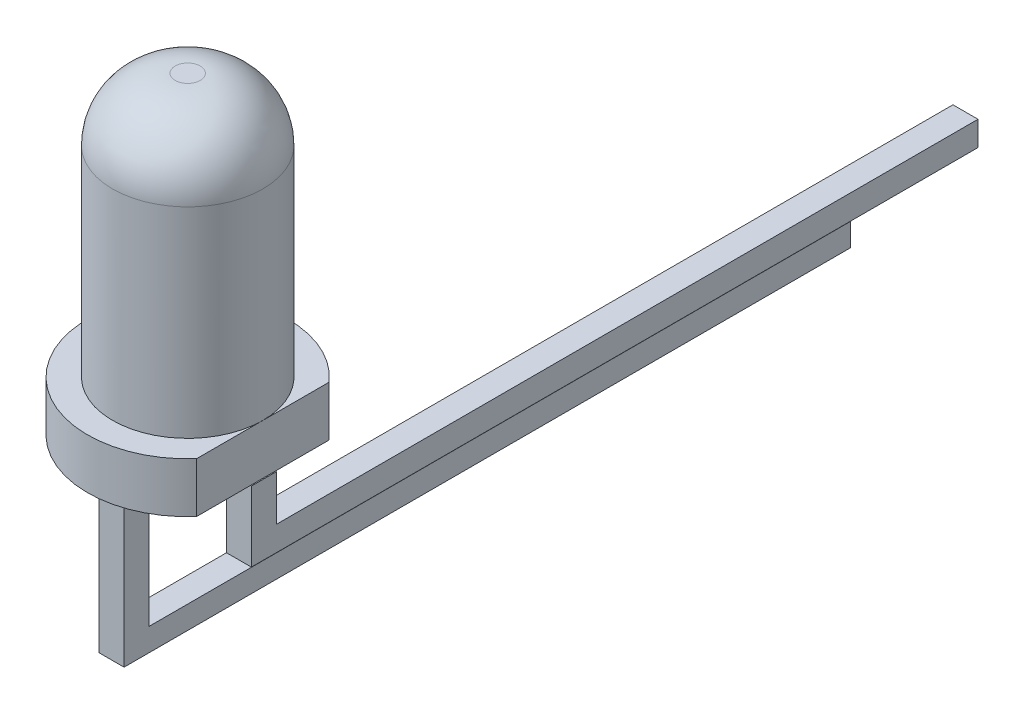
ISO-10303-21;
HEADER;
FILE_DESCRIPTION(('STEP AP214'),'2;1');
FILE_NAME('part.step','',(''),(''),'','','');
FILE_SCHEMA(('AUTOMOTIVE_DESIGN { 1 0 10303 214 1 1 1 1 }'));
ENDSEC;
DATA;
#1=APPLICATION_CONTEXT('core data for automotive mechanical design processes');
#2=APPLICATION_PROTOCOL_DEFINITION('international standard','automotive_design',2000,#1);
#3=PRODUCT_CONTEXT('',#1,'mechanical');
#4=PRODUCT('Part','Part','',(#3));
#5=PRODUCT_RELATED_PRODUCT_CATEGORY('part','',(#4));
#6=PRODUCT_DEFINITION_FORMATION('','',#4);
#7=PRODUCT_DEFINITION_CONTEXT('part definition',#1,'design');
#8=PRODUCT_DEFINITION('design','',#6,#7);
#9=PRODUCT_DEFINITION_SHAPE('','',#8);
#10=(LENGTH_UNIT() NAMED_UNIT(*) SI_UNIT(.MILLI.,.METRE.));
#11=(NAMED_UNIT(*) PLANE_ANGLE_UNIT() SI_UNIT($,.RADIAN.));
#12=(NAMED_UNIT(*) SI_UNIT($,.STERADIAN.) SOLID_ANGLE_UNIT());
#13=UNCERTAINTY_MEASURE_WITH_UNIT(LENGTH_MEASURE(1.E-05),#10,'distance_accuracy_value','');
#14=(GEOMETRIC_REPRESENTATION_CONTEXT(3) GLOBAL_UNCERTAINTY_ASSIGNED_CONTEXT((#13)) GLOBAL_UNIT_ASSIGNED_CONTEXT((#10,
#11,#12)) REPRESENTATION_CONTEXT('',''));
#15=CARTESIAN_POINT('',(0.,0.,0.));
#16=DIRECTION('',(0.,0.,1.));
#17=DIRECTION('',(1.,0.,0.));
#18=AXIS2_PLACEMENT_3D('',#15,#16,#17);
#19=CARTESIAN_POINT('',(-1.52014292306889,-1.4,-0.25));
#20=DIRECTION('',(0.,0.,1.));
#21=DIRECTION('',(1.,0.,0.));
#22=AXIS2_PLACEMENT_3D('',#19,#20,#21);
#23=PLANE('',#22);
#24=DIRECTION('',(1.,0.,0.));
#25=VECTOR('',#24,1.);
#26=CARTESIAN_POINT('',(-1.02014292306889,-3.94389942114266,-0.25));
#27=LINE('',#26,#25);
#28=CARTESIAN_POINT('',(-1.52014292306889,-3.94389942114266,-0.25));
#29=VERTEX_POINT('',#28);
#30=CARTESIAN_POINT('',(-1.02014292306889,-3.94389942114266,-0.25));
#31=VERTEX_POINT('',#30);
#32=EDGE_CURVE('E193',#29,#31,#27,.T.);
#33=ORIENTED_EDGE('',*,*,#32,.F.);
#34=DIRECTION('',(0.,1.,0.));
#35=VECTOR('',#34,1.);
#36=CARTESIAN_POINT('',(-1.52014292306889,-1.4,-0.25));
#37=LINE('',#36,#35);
#38=CARTESIAN_POINT('',(-1.52014292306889,0.,-0.25));
#39=VERTEX_POINT('',#38);
#40=EDGE_CURVE('E291',#29,#39,#37,.T.);
#41=ORIENTED_EDGE('',*,*,#40,.T.);
#42=DIRECTION('',(1.,0.,0.));
#43=VECTOR('',#42,1.);
#44=CARTESIAN_POINT('',(-1.52014292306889,0.,-0.25));
#45=LINE('',#44,#43);
#46=CARTESIAN_POINT('',(-1.02014292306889,0.,-0.25));
#47=VERTEX_POINT('',#46);
#48=EDGE_CURVE('E271',#39,#47,#45,.T.);
#49=ORIENTED_EDGE('',*,*,#48,.T.);
#50=DIRECTION('',(0.,1.,0.));
#51=VECTOR('',#50,1.);
#52=CARTESIAN_POINT('',(-1.02014292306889,-1.4,-0.25));
#53=LINE('',#52,#51);
#54=EDGE_CURVE('E288',#31,#47,#53,.T.);
#55=ORIENTED_EDGE('',*,*,#54,.F.);
#56=EDGE_LOOP('',(#33,#41,#49,#55));
#57=FACE_BOUND('',#56,.T.);
#58=ADVANCED_FACE('F38',(#57),#23,.F.);
#59=CARTESIAN_POINT('',(1.02017272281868,-1.4,-0.25));
#60=DIRECTION('',(0.,0.,1.));
#61=DIRECTION('',(1.,0.,0.));
#62=AXIS2_PLACEMENT_3D('',#59,#60,#61);
#63=PLANE('',#62);
#64=DIRECTION('',(1.,0.,0.));
#65=VECTOR('',#64,1.);
#66=CARTESIAN_POINT('',(1.02017272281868,-0.91036424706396,-0.25));
#67=LINE('',#66,#65);
#68=CARTESIAN_POINT('',(1.02017272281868,-0.91036424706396,-0.25));
#69=VERTEX_POINT('',#68);
#70=CARTESIAN_POINT('',(1.52017272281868,-0.91036424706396,-0.25));
#71=VERTEX_POINT('',#70);
#72=EDGE_CURVE('E176',#69,#71,#67,.T.);
#73=ORIENTED_EDGE('',*,*,#72,.F.);
#74=DIRECTION('',(0.,1.,0.));
#75=VECTOR('',#74,1.);
#76=CARTESIAN_POINT('',(1.02017272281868,-1.4,-0.25));
#77=LINE('',#76,#75);
#78=CARTESIAN_POINT('',(1.02017272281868,0.,-0.25));
#79=VERTEX_POINT('',#78);
#80=EDGE_CURVE('E61',#69,#79,#77,.T.);
#81=ORIENTED_EDGE('',*,*,#80,.T.);
#82=DIRECTION('',(1.,0.,0.));
#83=VECTOR('',#82,1.);
#84=CARTESIAN_POINT('',(1.02017272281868,0.,-0.25));
#85=LINE('',#84,#83);
#86=CARTESIAN_POINT('',(1.5,0.,-0.25));
#87=VERTEX_POINT('',#86);
#88=EDGE_CURVE('E251',#79,#87,#85,.T.);
#89=ORIENTED_EDGE('',*,*,#88,.T.);
#90=DIRECTION('',(-1.,0.,0.));
#91=VECTOR('',#90,1.);
#92=CARTESIAN_POINT('',(1.02017272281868,0.,-0.25));
#93=LINE('',#92,#91);
#94=CARTESIAN_POINT('',(1.52017272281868,0.,-0.25));
#95=VERTEX_POINT('',#94);
#96=EDGE_CURVE('E237',#95,#87,#93,.T.);
#97=ORIENTED_EDGE('',*,*,#96,.F.);
#98=DIRECTION('',(0.,1.,0.));
#99=VECTOR('',#98,1.);
#100=CARTESIAN_POINT('',(1.52017272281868,-1.4,-0.25));
#101=LINE('',#100,#99);
#102=EDGE_CURVE('E264',#71,#95,#101,.T.);
#103=ORIENTED_EDGE('',*,*,#102,.F.);
#104=EDGE_LOOP('',(#73,#81,#89,#97,#103));
#105=FACE_BOUND('',#104,.T.);
#106=ADVANCED_FACE('F332',(#105),#63,.F.);
#107=CARTESIAN_POINT('',(0.,0.,0.));
#108=DIRECTION('',(0.,1.,0.));
#109=DIRECTION('',(0.,0.,1.));
#110=AXIS2_PLACEMENT_3D('',#107,#108,#109);
#111=PLANE('',#110);
#112=DIRECTION('',(0.,0.,-1.));
#113=VECTOR('',#112,1.);
#114=CARTESIAN_POINT('',(-1.52014292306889,0.,-0.25));
#115=LINE('',#114,#113);
#116=CARTESIAN_POINT('',(-1.52014292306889,0.,0.25));
#117=VERTEX_POINT('',#116);
#118=EDGE_CURVE('E267',#117,#39,#115,.T.);
#119=ORIENTED_EDGE('',*,*,#118,.F.);
#120=DIRECTION('',(-1.,0.,0.));
#121=VECTOR('',#120,1.);
#122=CARTESIAN_POINT('',(-1.52014292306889,0.,0.25));
#123=LINE('',#122,#121);
#124=CARTESIAN_POINT('',(-1.02014292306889,0.,0.25));
#125=VERTEX_POINT('',#124);
#126=EDGE_CURVE('E278',#125,#117,#123,.T.);
#127=ORIENTED_EDGE('',*,*,#126,.F.);
#128=DIRECTION('',(0.,0.,1.));
#129=VECTOR('',#128,1.);
#130=CARTESIAN_POINT('',(-1.02014292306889,0.,-0.25));
#131=LINE('',#130,#129);
#132=EDGE_CURVE('E275',#47,#125,#131,.T.);
#133=ORIENTED_EDGE('',*,*,#132,.F.);
#134=ORIENTED_EDGE('',*,*,#48,.F.);
#135=EDGE_LOOP('',(#119,#127,#133,#134));
#136=FACE_BOUND('',#135,.T.);
#137=CARTESIAN_POINT('',(0.,0.,0.));
#138=DIRECTION('',(0.,1.,0.));
#139=DIRECTION('',(0.,0.,1.));
#140=AXIS2_PLACEMENT_3D('',#137,#138,#139);
#141=CIRCLE('',#140,2.);
#142=CARTESIAN_POINT('',(1.5,0.,-1.3228756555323));
#143=VERTEX_POINT('',#142);
#144=CARTESIAN_POINT('',(1.5,0.,1.32287565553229));
#145=VERTEX_POINT('',#144);
#146=EDGE_CURVE('E298',#143,#145,#141,.T.);
#147=ORIENTED_EDGE('',*,*,#146,.F.);
#148=DIRECTION('',(0.,0.,-1.));
#149=VECTOR('',#148,1.);
#150=CARTESIAN_POINT('',(1.5,0.,-2.73044739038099));
#151=LINE('',#150,#149);
#152=EDGE_CURVE('E234',#87,#143,#151,.T.);
#153=ORIENTED_EDGE('',*,*,#152,.F.);
#154=ORIENTED_EDGE('',*,*,#88,.F.);
#155=DIRECTION('',(0.,0.,-1.));
#156=VECTOR('',#155,1.);
#157=CARTESIAN_POINT('',(1.02017272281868,0.,-0.25));
#158=LINE('',#157,#156);
#159=CARTESIAN_POINT('',(1.02017272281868,0.,0.25));
#160=VERTEX_POINT('',#159);
#161=EDGE_CURVE('E239',#160,#79,#158,.T.);
#162=ORIENTED_EDGE('',*,*,#161,.F.);
#163=DIRECTION('',(-1.,0.,0.));
#164=VECTOR('',#163,1.);
#165=CARTESIAN_POINT('',(1.02017272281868,0.,0.25));
#166=LINE('',#165,#164);
#167=CARTESIAN_POINT('',(1.5,0.,0.25));
#168=VERTEX_POINT('',#167);
#169=EDGE_CURVE('E256',#168,#160,#166,.T.);
#170=ORIENTED_EDGE('',*,*,#169,.F.);
#171=EDGE_CURVE('E53',#145,#168,#151,.T.);
#172=ORIENTED_EDGE('',*,*,#171,.F.);
#173=EDGE_LOOP('',(#147,#153,#154,#162,#170,#172));
#174=FACE_BOUND('',#173,.T.);
#175=ADVANCED_FACE('F338',(#136,#174),#111,.F.);
#176=CARTESIAN_POINT('',(0.,1.,0.));
#177=DIRECTION('',(0.,1.,0.));
#178=DIRECTION('',(0.,0.,1.));
#179=AXIS2_PLACEMENT_3D('',#176,#177,#178);
#180=PLANE('',#179);
#181=DIRECTION('',(0.,0.,1.));
#182=VECTOR('',#181,1.);
#183=CARTESIAN_POINT('',(1.5,1.,-2.73044739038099));
#184=LINE('',#183,#182);
#185=CARTESIAN_POINT('',(1.5,1.,-1.3228756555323));
#186=VERTEX_POINT('',#185);
#187=CARTESIAN_POINT('',(1.5,1.,0.));
#188=VERTEX_POINT('',#187);
#189=EDGE_CURVE('E233',#186,#188,#184,.T.);
#190=ORIENTED_EDGE('',*,*,#189,.F.);
#191=CARTESIAN_POINT('',(0.,1.,0.));
#192=DIRECTION('',(0.,1.,0.));
#193=DIRECTION('',(0.,0.,1.));
#194=AXIS2_PLACEMENT_3D('',#191,#192,#193);
#195=CIRCLE('',#194,2.);
#196=CARTESIAN_POINT('',(1.5,1.,1.32287565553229));
#197=VERTEX_POINT('',#196);
#198=EDGE_CURVE('E299',#186,#197,#195,.T.);
#199=ORIENTED_EDGE('',*,*,#198,.T.);
#200=EDGE_CURVE('E231',#188,#197,#184,.T.);
#201=ORIENTED_EDGE('',*,*,#200,.F.);
#202=CARTESIAN_POINT('',(0.,1.,0.));
#203=DIRECTION('',(0.,1.,0.));
#204=DIRECTION('',(0.,0.,1.));
#205=AXIS2_PLACEMENT_3D('',#202,#203,#204);
#206=CIRCLE('',#205,1.5);
#207=EDGE_CURVE('E294',#188,#188,#206,.T.);
#208=ORIENTED_EDGE('',*,*,#207,.F.);
#209=EDGE_LOOP('',(#190,#199,#201,#208));
#210=FACE_BOUND('',#209,.T.);
#211=ADVANCED_FACE('F355',(#210),#180,.T.);
#212=CARTESIAN_POINT('',(0.,1.,0.));
#213=DIRECTION('',(0.,-1.,0.));
#214=DIRECTION('',(0.,0.,-1.));
#215=AXIS2_PLACEMENT_3D('',#212,#213,#214);
#216=CYLINDRICAL_SURFACE('',#215,2.);
#217=ORIENTED_EDGE('',*,*,#198,.F.);
#218=DIRECTION('',(0.,-1.,0.));
#219=VECTOR('',#218,1.);
#220=CARTESIAN_POINT('',(1.5,1.,-1.3228756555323));
#221=LINE('',#220,#219);
#222=EDGE_CURVE('E309',#186,#143,#221,.T.);
#223=ORIENTED_EDGE('',*,*,#222,.T.);
#224=ORIENTED_EDGE('',*,*,#146,.T.);
#225=DIRECTION('',(0.,-1.,0.));
#226=VECTOR('',#225,1.);
#227=CARTESIAN_POINT('',(1.5,1.,1.32287565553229));
#228=LINE('',#227,#226);
#229=EDGE_CURVE('E303',#145,#197,#228,.F.);
#230=ORIENTED_EDGE('',*,*,#229,.T.);
#231=EDGE_LOOP('',(#217,#223,#224,#230));
#232=FACE_BOUND('',#231,.T.);
#233=ADVANCED_FACE('F353',(#232),#216,.T.);
#234=CARTESIAN_POINT('',(0.,6.25,0.));
#235=DIRECTION('',(0.,-1.,0.));
#236=DIRECTION('',(0.,0.,-1.));
#237=AXIS2_PLACEMENT_3D('',#234,#235,#236);
#238=CYLINDRICAL_SURFACE('',#237,1.5);
#239=CARTESIAN_POINT('',(0.,5.,0.));
#240=DIRECTION('',(0.,1.,0.));
#241=DIRECTION('',(0.,0.,1.));
#242=AXIS2_PLACEMENT_3D('',#239,#240,#241);
#243=CIRCLE('',#242,1.5);
#244=CARTESIAN_POINT('',(0.,5.,1.5));
#245=VERTEX_POINT('',#244);
#246=EDGE_CURVE('E12',#245,#245,#243,.F.);
#247=ORIENTED_EDGE('',*,*,#246,.T.);
#248=EDGE_LOOP('',(#247));
#249=FACE_BOUND('',#248,.T.);
#250=ORIENTED_EDGE('',*,*,#207,.T.);
#251=EDGE_LOOP('',(#250));
#252=FACE_BOUND('',#251,.T.);
#253=ADVANCED_FACE('F350',(#249,#252),#238,.T.);
#254=CARTESIAN_POINT('',(0.,6.25,0.));
#255=DIRECTION('',(0.,1.,0.));
#256=DIRECTION('',(0.,0.,1.));
#257=AXIS2_PLACEMENT_3D('',#254,#255,#256);
#258=PLANE('',#257);
#259=CARTESIAN_POINT('',(0.,6.25,0.));
#260=DIRECTION('',(0.,1.,0.));
#261=DIRECTION('',(0.,0.,1.));
#262=AXIS2_PLACEMENT_3D('',#259,#260,#261);
#263=CIRCLE('',#262,0.25);
#264=CARTESIAN_POINT('',(0.,6.25,0.25));
#265=VERTEX_POINT('',#264);
#266=EDGE_CURVE('E46',#265,#265,#263,.T.);
#267=ORIENTED_EDGE('',*,*,#266,.T.);
#268=EDGE_LOOP('',(#267));
#269=FACE_BOUND('',#268,.T.);
#270=ADVANCED_FACE('F314',(#269),#258,.T.);
#271=CARTESIAN_POINT('',(-1.52014292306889,-1.4,-0.25));
#272=DIRECTION('',(1.,0.,0.));
#273=DIRECTION('',(0.,0.,-1.));
#274=AXIS2_PLACEMENT_3D('',#271,#272,#273);
#275=PLANE('',#274);
#276=ORIENTED_EDGE('',*,*,#118,.T.);
#277=ORIENTED_EDGE('',*,*,#40,.F.);
#278=DIRECTION('',(0.,0.,1.));
#279=VECTOR('',#278,1.);
#280=CARTESIAN_POINT('',(-1.52014292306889,-3.94389942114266,-14.25));
#281=LINE('',#280,#279);
#282=CARTESIAN_POINT('',(-1.52014292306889,-3.94389942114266,-14.25));
#283=VERTEX_POINT('',#282);
#284=EDGE_CURVE('E205',#283,#29,#281,.T.);
#285=ORIENTED_EDGE('',*,*,#284,.F.);
#286=DIRECTION('',(0.,1.,0.));
#287=VECTOR('',#286,1.);
#288=CARTESIAN_POINT('',(-1.52014292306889,-4.4,-14.25));
#289=LINE('',#288,#287);
#290=CARTESIAN_POINT('',(-1.52014292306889,-4.4,-14.25));
#291=VERTEX_POINT('',#290);
#292=EDGE_CURVE('E186',#291,#283,#289,.T.);
#293=ORIENTED_EDGE('',*,*,#292,.F.);
#294=DIRECTION('',(0.,0.,-1.));
#295=VECTOR('',#294,1.);
#296=CARTESIAN_POINT('',(-1.52014292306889,-4.4,0.25));
#297=LINE('',#296,#295);
#298=CARTESIAN_POINT('',(-1.52014292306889,-4.4,0.25));
#299=VERTEX_POINT('',#298);
#300=EDGE_CURVE('E177',#299,#291,#297,.T.);
#301=ORIENTED_EDGE('',*,*,#300,.F.);
#302=DIRECTION('',(0.,1.,0.));
#303=VECTOR('',#302,1.);
#304=CARTESIAN_POINT('',(-1.52014292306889,-1.4,0.25));
#305=LINE('',#304,#303);
#306=EDGE_CURVE('E282',#299,#117,#305,.T.);
#307=ORIENTED_EDGE('',*,*,#306,.T.);
#308=EDGE_LOOP('',(#276,#277,#285,#293,#301,#307));
#309=FACE_BOUND('',#308,.T.);
#310=ADVANCED_FACE('F344',(#309),#275,.F.);
#311=CARTESIAN_POINT('',(-1.02014292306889,-1.4,-0.25));
#312=DIRECTION('',(-1.,0.,0.));
#313=DIRECTION('',(0.,0.,1.));
#314=AXIS2_PLACEMENT_3D('',#311,#312,#313);
#315=PLANE('',#314);
#316=ORIENTED_EDGE('',*,*,#132,.T.);
#317=DIRECTION('',(0.,1.,0.));
#318=VECTOR('',#317,1.);
#319=CARTESIAN_POINT('',(-1.02014292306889,-1.4,0.25));
#320=LINE('',#319,#318);
#321=CARTESIAN_POINT('',(-1.02014292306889,-4.4,0.25));
#322=VERTEX_POINT('',#321);
#323=EDGE_CURVE('E171',#322,#125,#320,.T.);
#324=ORIENTED_EDGE('',*,*,#323,.F.);
#325=DIRECTION('',(0.,0.,1.));
#326=VECTOR('',#325,1.);
#327=CARTESIAN_POINT('',(-1.02014292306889,-4.4,-0.25));
#328=LINE('',#327,#326);
#329=CARTESIAN_POINT('',(-1.02014292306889,-4.4,-14.25));
#330=VERTEX_POINT('',#329);
#331=EDGE_CURVE('E163',#330,#322,#328,.T.);
#332=ORIENTED_EDGE('',*,*,#331,.F.);
#333=DIRECTION('',(0.,-1.,0.));
#334=VECTOR('',#333,1.);
#335=CARTESIAN_POINT('',(-1.02014292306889,-3.94389942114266,-14.25));
#336=LINE('',#335,#334);
#337=CARTESIAN_POINT('',(-1.02014292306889,-3.94389942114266,-14.25));
#338=VERTEX_POINT('',#337);
#339=EDGE_CURVE('E169',#338,#330,#336,.T.);
#340=ORIENTED_EDGE('',*,*,#339,.F.);
#341=DIRECTION('',(0.,0.,1.));
#342=VECTOR('',#341,1.);
#343=CARTESIAN_POINT('',(-1.02014292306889,-3.94389942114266,-14.25));
#344=LINE('',#343,#342);
#345=EDGE_CURVE('E201',#338,#31,#344,.T.);
#346=ORIENTED_EDGE('',*,*,#345,.T.);
#347=ORIENTED_EDGE('',*,*,#54,.T.);
#348=EDGE_LOOP('',(#316,#324,#332,#340,#346,#347));
#349=FACE_BOUND('',#348,.T.);
#350=ADVANCED_FACE('F166',(#349),#315,.F.);
#351=CARTESIAN_POINT('',(-1.52014292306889,-1.4,0.25));
#352=DIRECTION('',(0.,0.,-1.));
#353=DIRECTION('',(-1.,0.,0.));
#354=AXIS2_PLACEMENT_3D('',#351,#352,#353);
#355=PLANE('',#354);
#356=ORIENTED_EDGE('',*,*,#126,.T.);
#357=ORIENTED_EDGE('',*,*,#306,.F.);
#358=DIRECTION('',(-1.,0.,0.));
#359=VECTOR('',#358,1.);
#360=CARTESIAN_POINT('',(-1.02014292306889,-4.4,0.25));
#361=LINE('',#360,#359);
#362=EDGE_CURVE('E208',#322,#299,#361,.T.);
#363=ORIENTED_EDGE('',*,*,#362,.F.);
#364=ORIENTED_EDGE('',*,*,#323,.T.);
#365=EDGE_LOOP('',(#356,#357,#363,#364));
#366=FACE_BOUND('',#365,.T.);
#367=ADVANCED_FACE('F396',(#366),#355,.F.);
#368=CARTESIAN_POINT('',(1.02017272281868,-1.4,-0.25));
#369=DIRECTION('',(1.,0.,0.));
#370=DIRECTION('',(0.,0.,-1.));
#371=AXIS2_PLACEMENT_3D('',#368,#369,#370);
#372=PLANE('',#371);
#373=ORIENTED_EDGE('',*,*,#161,.T.);
#374=ORIENTED_EDGE('',*,*,#80,.F.);
#375=DIRECTION('',(0.,0.,1.));
#376=VECTOR('',#375,1.);
#377=CARTESIAN_POINT('',(1.02017272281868,-0.91036424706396,-14.25));
#378=LINE('',#377,#376);
#379=CARTESIAN_POINT('',(1.02017272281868,-0.91036424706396,-14.25));
#380=VERTEX_POINT('',#379);
#381=EDGE_CURVE('E224',#380,#69,#378,.T.);
#382=ORIENTED_EDGE('',*,*,#381,.F.);
#383=DIRECTION('',(0.,1.,0.));
#384=VECTOR('',#383,1.);
#385=CARTESIAN_POINT('',(1.02017272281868,-1.4,-14.25));
#386=LINE('',#385,#384);
#387=CARTESIAN_POINT('',(1.02017272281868,-1.4,-14.25));
#388=VERTEX_POINT('',#387);
#389=EDGE_CURVE('E222',#388,#380,#386,.T.);
#390=ORIENTED_EDGE('',*,*,#389,.F.);
#391=DIRECTION('',(0.,0.,-1.));
#392=VECTOR('',#391,1.);
#393=CARTESIAN_POINT('',(1.02017272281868,-1.4,-0.25));
#394=LINE('',#393,#392);
#395=CARTESIAN_POINT('',(1.02017272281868,-1.4,0.25));
#396=VERTEX_POINT('',#395);
#397=EDGE_CURVE('E240',#396,#388,#394,.T.);
#398=ORIENTED_EDGE('',*,*,#397,.F.);
#399=DIRECTION('',(0.,1.,0.));
#400=VECTOR('',#399,1.);
#401=CARTESIAN_POINT('',(1.02017272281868,-1.4,0.25));
#402=LINE('',#401,#400);
#403=EDGE_CURVE('E248',#396,#160,#402,.T.);
#404=ORIENTED_EDGE('',*,*,#403,.T.);
#405=EDGE_LOOP('',(#373,#374,#382,#390,#398,#404));
#406=FACE_BOUND('',#405,.T.);
#407=ADVANCED_FACE('F394',(#406),#372,.F.);
#408=CARTESIAN_POINT('',(1.52017272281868,-1.4,-0.25));
#409=DIRECTION('',(-1.,0.,0.));
#410=DIRECTION('',(0.,0.,1.));
#411=AXIS2_PLACEMENT_3D('',#408,#409,#410);
#412=PLANE('',#411);
#413=DIRECTION('',(0.,0.,1.));
#414=VECTOR('',#413,1.);
#415=CARTESIAN_POINT('',(1.52017272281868,0.,-0.25));
#416=LINE('',#415,#414);
#417=CARTESIAN_POINT('',(1.52017272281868,0.,0.25));
#418=VERTEX_POINT('',#417);
#419=EDGE_CURVE('E253',#95,#418,#416,.T.);
#420=ORIENTED_EDGE('',*,*,#419,.T.);
#421=DIRECTION('',(0.,1.,0.));
#422=VECTOR('',#421,1.);
#423=CARTESIAN_POINT('',(1.52017272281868,-1.4,0.25));
#424=LINE('',#423,#422);
#425=CARTESIAN_POINT('',(1.52017272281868,-1.4,0.25));
#426=VERTEX_POINT('',#425);
#427=EDGE_CURVE('E261',#426,#418,#424,.T.);
#428=ORIENTED_EDGE('',*,*,#427,.F.);
#429=DIRECTION('',(0.,0.,1.));
#430=VECTOR('',#429,1.);
#431=CARTESIAN_POINT('',(1.52017272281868,-1.4,-0.25));
#432=LINE('',#431,#430);
#433=CARTESIAN_POINT('',(1.52017272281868,-1.4,-14.25));
#434=VERTEX_POINT('',#433);
#435=EDGE_CURVE('E243',#434,#426,#432,.T.);
#436=ORIENTED_EDGE('',*,*,#435,.F.);
#437=DIRECTION('',(0.,-1.,0.));
#438=VECTOR('',#437,1.);
#439=CARTESIAN_POINT('',(1.52017272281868,-0.91036424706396,-14.25));
#440=LINE('',#439,#438);
#441=CARTESIAN_POINT('',(1.52017272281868,-0.91036424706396,-14.25));
#442=VERTEX_POINT('',#441);
#443=EDGE_CURVE('E216',#442,#434,#440,.T.);
#444=ORIENTED_EDGE('',*,*,#443,.F.);
#445=DIRECTION('',(0.,0.,1.));
#446=VECTOR('',#445,1.);
#447=CARTESIAN_POINT('',(1.52017272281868,-0.91036424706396,-14.25));
#448=LINE('',#447,#446);
#449=EDGE_CURVE('E229',#442,#71,#448,.T.);
#450=ORIENTED_EDGE('',*,*,#449,.T.);
#451=ORIENTED_EDGE('',*,*,#102,.T.);
#452=EDGE_LOOP('',(#420,#428,#436,#444,#450,#451));
#453=FACE_BOUND('',#452,.T.);
#454=ADVANCED_FACE('F379',(#453),#412,.F.);
#455=CARTESIAN_POINT('',(1.02017272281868,-1.4,0.25));
#456=DIRECTION('',(0.,0.,-1.));
#457=DIRECTION('',(-1.,0.,0.));
#458=AXIS2_PLACEMENT_3D('',#455,#456,#457);
#459=PLANE('',#458);
#460=EDGE_CURVE('E244',#418,#168,#166,.T.);
#461=ORIENTED_EDGE('',*,*,#460,.T.);
#462=ORIENTED_EDGE('',*,*,#169,.T.);
#463=ORIENTED_EDGE('',*,*,#403,.F.);
#464=DIRECTION('',(-1.,0.,0.));
#465=VECTOR('',#464,1.);
#466=CARTESIAN_POINT('',(1.02017272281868,-1.4,0.25));
#467=LINE('',#466,#465);
#468=EDGE_CURVE('E246',#426,#396,#467,.T.);
#469=ORIENTED_EDGE('',*,*,#468,.F.);
#470=ORIENTED_EDGE('',*,*,#427,.T.);
#471=EDGE_LOOP('',(#461,#462,#463,#469,#470));
#472=FACE_BOUND('',#471,.T.);
#473=ADVANCED_FACE('F382',(#472),#459,.F.);
#474=CARTESIAN_POINT('',(1.02017272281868,-1.4,0.25));
#475=DIRECTION('',(0.,1.,0.));
#476=DIRECTION('',(0.,0.,1.));
#477=AXIS2_PLACEMENT_3D('',#474,#475,#476);
#478=PLANE('',#477);
#479=ORIENTED_EDGE('',*,*,#397,.T.);
#480=DIRECTION('',(-1.,0.,0.));
#481=VECTOR('',#480,1.);
#482=CARTESIAN_POINT('',(1.52017272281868,-1.4,-14.25));
#483=LINE('',#482,#481);
#484=EDGE_CURVE('E219',#434,#388,#483,.T.);
#485=ORIENTED_EDGE('',*,*,#484,.F.);
#486=ORIENTED_EDGE('',*,*,#435,.T.);
#487=ORIENTED_EDGE('',*,*,#468,.T.);
#488=EDGE_LOOP('',(#479,#485,#486,#487));
#489=FACE_BOUND('',#488,.T.);
#490=ADVANCED_FACE('F386',(#489),#478,.F.);
#491=CARTESIAN_POINT('',(1.5,-4.60977222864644,-2.73044739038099));
#492=DIRECTION('',(-1.,0.,0.));
#493=DIRECTION('',(0.,0.,1.));
#494=AXIS2_PLACEMENT_3D('',#491,#492,#493);
#495=PLANE('',#494);
#496=ORIENTED_EDGE('',*,*,#189,.T.);
#497=ORIENTED_EDGE('',*,*,#200,.T.);
#498=ORIENTED_EDGE('',*,*,#229,.F.);
#499=ORIENTED_EDGE('',*,*,#171,.T.);
#500=EDGE_CURVE('E236',#168,#87,#151,.T.);
#501=ORIENTED_EDGE('',*,*,#500,.T.);
#502=ORIENTED_EDGE('',*,*,#152,.T.);
#503=ORIENTED_EDGE('',*,*,#222,.F.);
#504=EDGE_LOOP('',(#496,#497,#498,#499,#501,#502,#503));
#505=FACE_BOUND('',#504,.T.);
#506=ADVANCED_FACE('F327',(#505),#495,.F.);
#507=CARTESIAN_POINT('',(0.,0.,0.));
#508=DIRECTION('',(0.,1.,0.));
#509=DIRECTION('',(0.,0.,1.));
#510=AXIS2_PLACEMENT_3D('',#507,#508,#509);
#511=PLANE('',#510);
#512=ORIENTED_EDGE('',*,*,#96,.T.);
#513=ORIENTED_EDGE('',*,*,#500,.F.);
#514=ORIENTED_EDGE('',*,*,#460,.F.);
#515=ORIENTED_EDGE('',*,*,#419,.F.);
#516=EDGE_LOOP('',(#512,#513,#514,#515));
#517=FACE_BOUND('',#516,.T.);
#518=ADVANCED_FACE('F318',(#517),#511,.T.);
#519=CARTESIAN_POINT('',(0.,5.,0.));
#520=DIRECTION('',(0.,1.,0.));
#521=DIRECTION('',(0.,0.,1.));
#522=AXIS2_PLACEMENT_3D('',#519,#520,#521);
#523=DEGENERATE_TOROIDAL_SURFACE('',#522,0.25,1.25,.T.);
#524=ORIENTED_EDGE('',*,*,#246,.F.);
#525=EDGE_LOOP('',(#524));
#526=FACE_BOUND('',#525,.T.);
#527=ORIENTED_EDGE('',*,*,#266,.F.);
#528=EDGE_LOOP('',(#527));
#529=FACE_BOUND('',#528,.T.);
#530=ADVANCED_FACE('F40',(#526,#529),#523,.T.);
#531=CARTESIAN_POINT('',(1.02017272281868,-0.91036424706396,-14.25));
#532=DIRECTION('',(0.,-1.,0.));
#533=DIRECTION('',(1.,0.,0.));
#534=AXIS2_PLACEMENT_3D('',#531,#532,#533);
#535=PLANE('',#534);
#536=ORIENTED_EDGE('',*,*,#72,.T.);
#537=ORIENTED_EDGE('',*,*,#449,.F.);
#538=DIRECTION('',(1.,0.,0.));
#539=VECTOR('',#538,1.);
#540=CARTESIAN_POINT('',(1.02017272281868,-0.91036424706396,-14.25));
#541=LINE('',#540,#539);
#542=EDGE_CURVE('E213',#380,#442,#541,.T.);
#543=ORIENTED_EDGE('',*,*,#542,.F.);
#544=ORIENTED_EDGE('',*,*,#381,.T.);
#545=EDGE_LOOP('',(#536,#537,#543,#544));
#546=FACE_BOUND('',#545,.T.);
#547=ADVANCED_FACE('F317',(#546),#535,.F.);
#548=CARTESIAN_POINT('',(1.52017272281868,-0.91036424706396,-14.25));
#549=DIRECTION('',(0.,0.,-1.));
#550=DIRECTION('',(-1.,0.,0.));
#551=AXIS2_PLACEMENT_3D('',#548,#549,#550);
#552=PLANE('',#551);
#553=ORIENTED_EDGE('',*,*,#542,.T.);
#554=ORIENTED_EDGE('',*,*,#443,.T.);
#555=ORIENTED_EDGE('',*,*,#484,.T.);
#556=ORIENTED_EDGE('',*,*,#389,.T.);
#557=EDGE_LOOP('',(#553,#554,#555,#556));
#558=FACE_BOUND('',#557,.T.);
#559=ADVANCED_FACE('F324',(#558),#552,.T.);
#560=CARTESIAN_POINT('',(-1.52014292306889,-4.4,0.25));
#561=DIRECTION('',(0.,-1.,0.));
#562=DIRECTION('',(0.,0.,-1.));
#563=AXIS2_PLACEMENT_3D('',#560,#561,#562);
#564=PLANE('',#563);
#565=ORIENTED_EDGE('',*,*,#362,.T.);
#566=ORIENTED_EDGE('',*,*,#300,.T.);
#567=DIRECTION('',(-1.,0.,0.));
#568=VECTOR('',#567,1.);
#569=CARTESIAN_POINT('',(-1.02014292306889,-4.4,-14.25));
#570=LINE('',#569,#568);
#571=EDGE_CURVE('E180',#330,#291,#570,.T.);
#572=ORIENTED_EDGE('',*,*,#571,.F.);
#573=ORIENTED_EDGE('',*,*,#331,.T.);
#574=EDGE_LOOP('',(#565,#566,#572,#573));
#575=FACE_BOUND('',#574,.T.);
#576=ADVANCED_FACE('F181',(#575),#564,.T.);
#577=CARTESIAN_POINT('',(-1.02014292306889,-3.94389942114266,-14.25));
#578=DIRECTION('',(0.,-1.,0.));
#579=DIRECTION('',(0.,0.,-1.));
#580=AXIS2_PLACEMENT_3D('',#577,#578,#579);
#581=PLANE('',#580);
#582=ORIENTED_EDGE('',*,*,#32,.T.);
#583=ORIENTED_EDGE('',*,*,#345,.F.);
#584=DIRECTION('',(1.,0.,0.));
#585=VECTOR('',#584,1.);
#586=CARTESIAN_POINT('',(-1.02014292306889,-3.94389942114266,-14.25));
#587=LINE('',#586,#585);
#588=EDGE_CURVE('E190',#283,#338,#587,.T.);
#589=ORIENTED_EDGE('',*,*,#588,.F.);
#590=ORIENTED_EDGE('',*,*,#284,.T.);
#591=EDGE_LOOP('',(#582,#583,#589,#590));
#592=FACE_BOUND('',#591,.T.);
#593=ADVANCED_FACE('F415',(#592),#581,.F.);
#594=CARTESIAN_POINT('',(-1.02014292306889,-4.4,-14.25));
#595=DIRECTION('',(0.,0.,-1.));
#596=DIRECTION('',(-1.,0.,0.));
#597=AXIS2_PLACEMENT_3D('',#594,#595,#596);
#598=PLANE('',#597);
#599=ORIENTED_EDGE('',*,*,#339,.T.);
#600=ORIENTED_EDGE('',*,*,#571,.T.);
#601=ORIENTED_EDGE('',*,*,#292,.T.);
#602=ORIENTED_EDGE('',*,*,#588,.T.);
#603=EDGE_LOOP('',(#599,#600,#601,#602));
#604=FACE_BOUND('',#603,.T.);
#605=ADVANCED_FACE('F188',(#604),#598,.T.);
#606=CLOSED_SHELL('',(#58,#106,#175,#211,#233,#253,#270,#310,#350,#367,#407,#454,#473,#490,#506,
#518,#530,#547,#559,#576,#593,#605));
#607=MANIFOLD_SOLID_BREP('B2',#606);
#608=ADVANCED_BREP_SHAPE_REPRESENTATION('',(#18,#607),#14);
#609=SHAPE_DEFINITION_REPRESENTATION(#9,#608);
ENDSEC;
END-ISO-10303-21;
